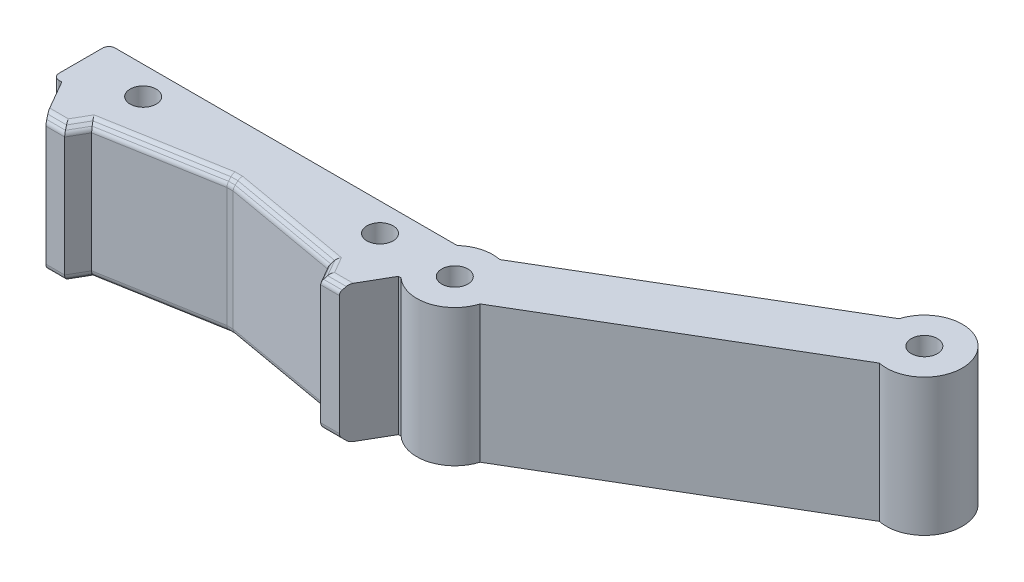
from build123d import *

# Parameters (mm, degrees)
ESQUISSE1_R        = 2.1
BOSS_EXTRU_1_DEPTH = 11
BOSS_EXTRU_2_DEPTH = 22
CHANFREIN1_SIZE    = 1
CONG_1_R           = 1


with BuildPart() as part:
    # Esquisse1 → Boss.-Extru.1 (new, symmetric)
    with BuildSketch(Plane(origin=(0, 0, 0), x_dir=(1, 0, 0), z_dir=(0, 1, 0))):
        with BuildLine():
            Line((-4.118252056, -4.5), (-59, -4.5))
            ThreePointArc((-59, -4.5), (-59.707106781, -4.207106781), (-60, -3.5))
            Line((-60, -3.5), (-60, 3.5))
            ThreePointArc((-60, 3.5), (-59.707106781, 4.207106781), (-59, 4.5))
            Line((-59, 4.5), (-4.118252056, 4.5))
            ThreePointArc((-4.118252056, 4.5), (-1.609794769, 5.883753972), (1.253722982, 5.96977208))
            Line((1.253722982, 5.96977208), (41.503660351, 29.776642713))
            ThreePointArc((41.503660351, 29.776642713), (52.589549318, 31.105454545), (46.085478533, 22.03022792))
            Line((46.085478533, 22.03022792), (5.835541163, -1.776642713))
            ThreePointArc((5.835541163, -1.776642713), (1.609794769, -5.883753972), (-4.118252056, -4.5))
        make_face()
        with Locations(Location((0, 0, 0), (0, 0, 270))):
            Circle(ESQUISSE1_R, mode=Mode.SUBTRACT)
        with Locations(Location((47.339201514, 28, 0), (0, 0, 270))):
            Circle(ESQUISSE1_R, mode=Mode.SUBTRACT)
        with Locations(Location((-50, 0, 0), (0, 0, 270))):
            Circle(ESQUISSE1_R, mode=Mode.SUBTRACT)
        with Locations(Location((-12, 0, 0), (0, 0, 270))):
            Circle(ESQUISSE1_R, mode=Mode.SUBTRACT)
    extrude(amount=BOSS_EXTRU_1_DEPTH, both=True)

    # Esquisse2 → Boss.-Extru.2 (add)
    with BuildSketch(Plane.XZ.offset(11)):
        Polygon((-12.609068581, 7.753242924), (-31.059126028, 4.5), (-4.559126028, 4.5), (-8.023227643, 10.5), (-11.023227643, 10.5), align=None)
        Polygon((-58.559126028, 4.5), (-32.059126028, 4.5), (-50.509183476, 7.753242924), (-52.095024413, 10.5), (-55.095024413, 10.5), align=None)
    extrude(amount=-BOSS_EXTRU_2_DEPTH)

    # Chanfrein1
    chanfrein1_edges = [part.edges().sort_by_distance(p)[0] for p in [
        (-31.559126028, -11, 4.5),
        (-31.559126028, 11, 4.5),
        (-41.284154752, -11, 6.126621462),
        (-51.302103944, -11, 9.126621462),
        (-53.595024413, -11, 10.5),
        (-53.595024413, 11, 10.5),
        (-51.302103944, 11, 9.126621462),
        (-41.284154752, 11, 6.126621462),
        (-11.816148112, -11, 9.126621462),
        (-21.834097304, -11, 6.126621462),
        (-9.523227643, -11, 10.5),
        (-11.816148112, 11, 9.126621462),
        (-9.523227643, 11, 10.5),
        (-21.834097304, 11, 6.126621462),
    ]]
    chamfer(chanfrein1_edges, length=CHANFREIN1_SIZE)

    # Cong_1
    cong_1_edges = [part.edges().sort_by_distance(p)[0] for p in [
        (-8.945877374, 11, 9.5),
        (-11.21103719, 11, 8.174704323),
        (-21.473917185, 11, 5.174704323),
        (-31.559126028, 11, 3.5),
        (-41.644334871, 11, 5.174704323),
        (-51.907214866, 11, 8.174704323),
        (-54.172374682, 11, 9.5),
        (-53.595024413, -10, 10.5),
        (-53.595024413, 10, 10.5),
        (-51.302103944, -10, 9.126621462),
        (-51.302103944, 10, 9.126621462),
        (-41.284154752, -10, 6.126621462),
        (-41.284154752, 10, 6.126621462),
        (-31.559126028, -10, 4.5),
        (-31.559126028, 10, 4.5),
        (-21.834097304, -10, 6.126621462),
        (-21.834097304, 10, 6.126621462),
        (-11.816148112, -10, 9.126621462),
        (-11.816148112, 10, 9.126621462),
        (-9.523227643, -10, 10.5),
        (-9.523227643, 10, 10.5),
        (-11.21103719, -11, 8.174704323),
        (-21.473917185, -11, 5.174704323),
        (-31.559126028, -11, 3.5),
        (-41.644334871, -11, 5.174704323),
        (-51.907214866, -11, 8.174704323),
        (-54.172374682, -11, 9.5),
        (-8.945877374, -11, 9.5),
    ]]
    fillet(cong_1_edges, radius=CONG_1_R)


solid = part.part
